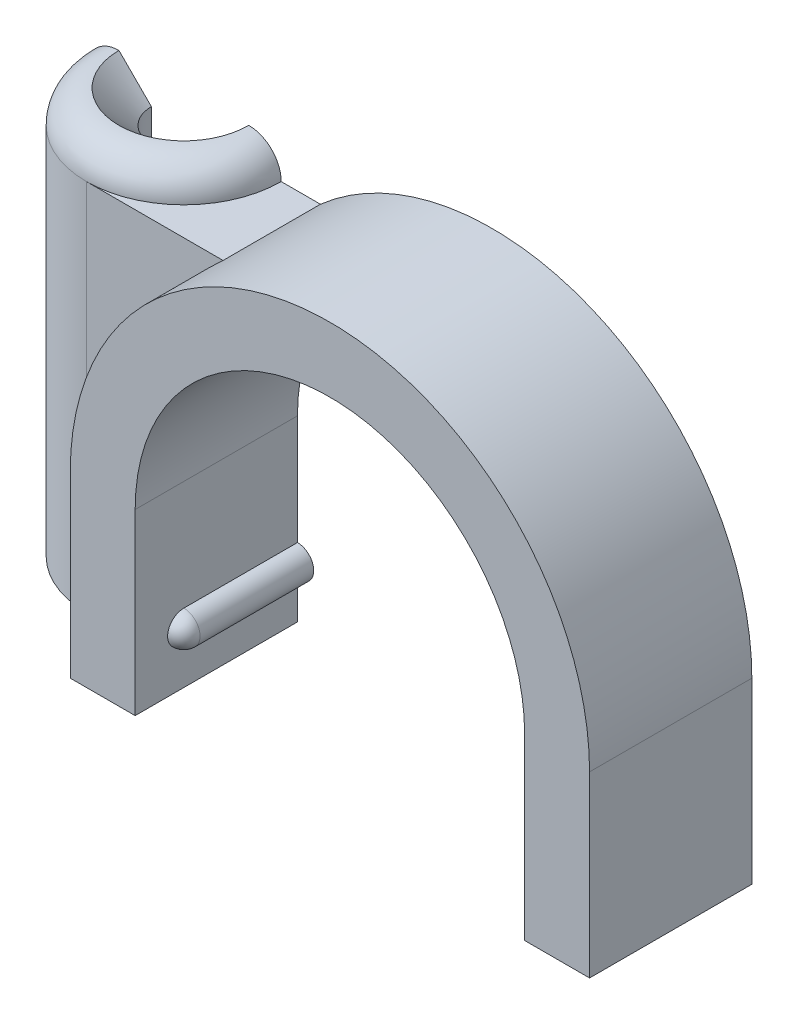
ISO-10303-21;
HEADER;
FILE_DESCRIPTION(('STEP AP214'),'2;1');
FILE_NAME('part.step','',(''),(''),'','','');
FILE_SCHEMA(('AUTOMOTIVE_DESIGN { 1 0 10303 214 1 1 1 1 }'));
ENDSEC;
DATA;
#1=APPLICATION_CONTEXT('core data for automotive mechanical design processes');
#2=APPLICATION_PROTOCOL_DEFINITION('international standard','automotive_design',2000,#1);
#3=PRODUCT_CONTEXT('',#1,'mechanical');
#4=PRODUCT('Part','Part','',(#3));
#5=PRODUCT_RELATED_PRODUCT_CATEGORY('part','',(#4));
#6=PRODUCT_DEFINITION_FORMATION('','',#4);
#7=PRODUCT_DEFINITION_CONTEXT('part definition',#1,'design');
#8=PRODUCT_DEFINITION('design','',#6,#7);
#9=PRODUCT_DEFINITION_SHAPE('','',#8);
#10=(LENGTH_UNIT() NAMED_UNIT(*) SI_UNIT(.MILLI.,.METRE.));
#11=(NAMED_UNIT(*) PLANE_ANGLE_UNIT() SI_UNIT($,.RADIAN.));
#12=(NAMED_UNIT(*) SI_UNIT($,.STERADIAN.) SOLID_ANGLE_UNIT());
#13=UNCERTAINTY_MEASURE_WITH_UNIT(LENGTH_MEASURE(1.E-05),#10,'distance_accuracy_value','');
#14=(GEOMETRIC_REPRESENTATION_CONTEXT(3) GLOBAL_UNCERTAINTY_ASSIGNED_CONTEXT((#13)) GLOBAL_UNIT_ASSIGNED_CONTEXT((#10,
#11,#12)) REPRESENTATION_CONTEXT('',''));
#15=CARTESIAN_POINT('',(0.,0.,0.));
#16=DIRECTION('',(0.,0.,1.));
#17=DIRECTION('',(1.,0.,0.));
#18=AXIS2_PLACEMENT_3D('',#15,#16,#17);
#19=CARTESIAN_POINT('',(0.,0.,-10.));
#20=DIRECTION('',(0.,-1.,0.));
#21=DIRECTION('',(0.,0.,-1.));
#22=AXIS2_PLACEMENT_3D('',#19,#20,#21);
#23=PLANE('',#22);
#24=CARTESIAN_POINT('',(-1.5,1.1369377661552E-11,-5.));
#25=DIRECTION('',(0.,1.,0.));
#26=DIRECTION('',(0.,0.,1.));
#27=AXIS2_PLACEMENT_3D('',#24,#25,#26);
#28=CIRCLE('',#27,0.999999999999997);
#29=CARTESIAN_POINT('',(-2.5,1.1369377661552E-11,-5.));
#30=VERTEX_POINT('',#29);
#31=CARTESIAN_POINT('',(-0.500000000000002,1.1369377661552E-11,-5.));
#32=VERTEX_POINT('',#31);
#33=EDGE_CURVE('E196',#30,#32,#28,.T.);
#34=ORIENTED_EDGE('',*,*,#33,.T.);
#35=DIRECTION('',(-1.,0.,0.));
#36=VECTOR('',#35,1.);
#37=CARTESIAN_POINT('',(-5.46231696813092,0.,-5.));
#38=LINE('',#37,#36);
#39=CARTESIAN_POINT('',(2.,0.,-5.));
#40=VERTEX_POINT('',#39);
#41=EDGE_CURVE('E187',#40,#32,#38,.T.);
#42=ORIENTED_EDGE('',*,*,#41,.F.);
#43=DIRECTION('',(0.,0.,1.));
#44=VECTOR('',#43,1.);
#45=CARTESIAN_POINT('',(2.,0.,-10.));
#46=LINE('',#45,#44);
#47=CARTESIAN_POINT('',(2.,0.,0.));
#48=VERTEX_POINT('',#47);
#49=EDGE_CURVE('E249',#40,#48,#46,.T.);
#50=ORIENTED_EDGE('',*,*,#49,.T.);
#51=DIRECTION('',(1.,0.,0.));
#52=VECTOR('',#51,1.);
#53=CARTESIAN_POINT('',(0.,0.,0.));
#54=LINE('',#53,#52);
#55=CARTESIAN_POINT('',(0.,0.,0.));
#56=VERTEX_POINT('',#55);
#57=EDGE_CURVE('E225',#56,#48,#54,.T.);
#58=ORIENTED_EDGE('',*,*,#57,.F.);
#59=DIRECTION('',(0.,0.,1.));
#60=VECTOR('',#59,1.);
#61=CARTESIAN_POINT('',(0.,0.,-10.));
#62=LINE('',#61,#60);
#63=CARTESIAN_POINT('',(0.,0.,-2.));
#64=VERTEX_POINT('',#63);
#65=EDGE_CURVE('E250',#64,#56,#62,.T.);
#66=ORIENTED_EDGE('',*,*,#65,.F.);
#67=DIRECTION('',(-1.,0.,0.));
#68=VECTOR('',#67,1.);
#69=CARTESIAN_POINT('',(16.001,0.,-2.));
#70=LINE('',#69,#68);
#71=CARTESIAN_POINT('',(-1.5,0.,-2.));
#72=VERTEX_POINT('',#71);
#73=EDGE_CURVE('E209',#64,#72,#70,.T.);
#74=ORIENTED_EDGE('',*,*,#73,.T.);
#75=CARTESIAN_POINT('',(-1.5,0.,-5.));
#76=DIRECTION('',(0.,-1.,0.));
#77=DIRECTION('',(0.,0.,-1.));
#78=AXIS2_PLACEMENT_3D('',#75,#76,#77);
#79=CIRCLE('',#78,3.);
#80=CARTESIAN_POINT('',(-4.5,0.,-5.));
#81=VERTEX_POINT('',#80);
#82=EDGE_CURVE('E218',#72,#81,#79,.T.);
#83=ORIENTED_EDGE('',*,*,#82,.T.);
#84=EDGE_CURVE('E181',#30,#81,#38,.T.);
#85=ORIENTED_EDGE('',*,*,#84,.F.);
#86=EDGE_LOOP('',(#34,#42,#50,#58,#66,#74,#83,#85));
#87=FACE_BOUND('',#86,.T.);
#88=ADVANCED_FACE('F29',(#87),#23,.T.);
#89=CARTESIAN_POINT('',(8.,5.5,-10.));
#90=DIRECTION('',(0.,0.,1.));
#91=DIRECTION('',(1.,0.,0.));
#92=AXIS2_PLACEMENT_3D('',#89,#90,#91);
#93=CYLINDRICAL_SURFACE('',#92,8.);
#94=DIRECTION('',(0.,0.,1.));
#95=VECTOR('',#94,1.);
#96=CARTESIAN_POINT('',(16.,5.5,-10.));
#97=LINE('',#96,#95);
#98=CARTESIAN_POINT('',(16.,5.5,-5.));
#99=VERTEX_POINT('',#98);
#100=CARTESIAN_POINT('',(16.,5.5,0.));
#101=VERTEX_POINT('',#100);
#102=EDGE_CURVE('E255',#99,#101,#97,.T.);
#103=ORIENTED_EDGE('',*,*,#102,.F.);
#104=CARTESIAN_POINT('',(8.,5.5,-5.));
#105=DIRECTION('',(0.,0.,-1.));
#106=DIRECTION('',(-1.,0.,0.));
#107=AXIS2_PLACEMENT_3D('',#104,#105,#106);
#108=CIRCLE('',#107,8.);
#109=CARTESIAN_POINT('',(2.70849737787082,11.5,-5.));
#110=VERTEX_POINT('',#109);
#111=EDGE_CURVE('E339',#110,#99,#108,.T.);
#112=ORIENTED_EDGE('',*,*,#111,.F.);
#113=DIRECTION('',(0.,0.,1.));
#114=VECTOR('',#113,1.);
#115=CARTESIAN_POINT('',(2.70849737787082,11.5,-10.));
#116=LINE('',#115,#114);
#117=CARTESIAN_POINT('',(2.70849737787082,11.5,-2.));
#118=VERTEX_POINT('',#117);
#119=EDGE_CURVE('E211',#118,#110,#116,.F.);
#120=ORIENTED_EDGE('',*,*,#119,.F.);
#121=CARTESIAN_POINT('',(8.,5.5,-2.));
#122=DIRECTION('',(0.,0.,-1.));
#123=DIRECTION('',(0.,1.,0.));
#124=AXIS2_PLACEMENT_3D('',#121,#122,#123);
#125=CIRCLE('',#124,8.);
#126=CARTESIAN_POINT('',(0.,5.5,-2.));
#127=VERTEX_POINT('',#126);
#128=EDGE_CURVE('E216',#127,#118,#125,.T.);
#129=ORIENTED_EDGE('',*,*,#128,.F.);
#130=DIRECTION('',(0.,0.,1.));
#131=VECTOR('',#130,1.);
#132=CARTESIAN_POINT('',(0.,5.5,-10.));
#133=LINE('',#132,#131);
#134=CARTESIAN_POINT('',(0.,5.5,0.));
#135=VERTEX_POINT('',#134);
#136=EDGE_CURVE('E253',#127,#135,#133,.T.);
#137=ORIENTED_EDGE('',*,*,#136,.T.);
#138=CARTESIAN_POINT('',(8.,5.5,0.));
#139=DIRECTION('',(0.,0.,1.));
#140=DIRECTION('',(-1.,0.,0.));
#141=AXIS2_PLACEMENT_3D('',#138,#139,#140);
#142=CIRCLE('',#141,8.);
#143=EDGE_CURVE('E243',#101,#135,#142,.T.);
#144=ORIENTED_EDGE('',*,*,#143,.F.);
#145=EDGE_LOOP('',(#103,#112,#120,#129,#137,#144));
#146=FACE_BOUND('',#145,.T.);
#147=ADVANCED_FACE('F291',(#146),#93,.T.);
#148=CARTESIAN_POINT('',(16.,0.,-10.));
#149=DIRECTION('',(1.,0.,0.));
#150=DIRECTION('',(0.,0.,-1.));
#151=AXIS2_PLACEMENT_3D('',#148,#149,#150);
#152=PLANE('',#151);
#153=DIRECTION('',(0.,0.,1.));
#154=VECTOR('',#153,1.);
#155=CARTESIAN_POINT('',(16.,0.,-10.));
#156=LINE('',#155,#154);
#157=CARTESIAN_POINT('',(16.,0.,-5.));
#158=VERTEX_POINT('',#157);
#159=CARTESIAN_POINT('',(16.,0.,0.));
#160=VERTEX_POINT('',#159);
#161=EDGE_CURVE('E257',#158,#160,#156,.T.);
#162=ORIENTED_EDGE('',*,*,#161,.F.);
#163=DIRECTION('',(0.,-1.,0.));
#164=VECTOR('',#163,1.);
#165=CARTESIAN_POINT('',(16.,13.9011627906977,-5.));
#166=LINE('',#165,#164);
#167=EDGE_CURVE('E343',#99,#158,#166,.T.);
#168=ORIENTED_EDGE('',*,*,#167,.F.);
#169=ORIENTED_EDGE('',*,*,#102,.T.);
#170=DIRECTION('',(0.,1.,0.));
#171=VECTOR('',#170,1.);
#172=CARTESIAN_POINT('',(16.,0.,0.));
#173=LINE('',#172,#171);
#174=EDGE_CURVE('E240',#160,#101,#173,.T.);
#175=ORIENTED_EDGE('',*,*,#174,.F.);
#176=EDGE_LOOP('',(#162,#168,#169,#175));
#177=FACE_BOUND('',#176,.T.);
#178=ADVANCED_FACE('F296',(#177),#152,.T.);
#179=CARTESIAN_POINT('',(14.,0.,-10.));
#180=DIRECTION('',(0.,-1.,0.));
#181=DIRECTION('',(0.,0.,-1.));
#182=AXIS2_PLACEMENT_3D('',#179,#180,#181);
#183=PLANE('',#182);
#184=DIRECTION('',(0.,0.,1.));
#185=VECTOR('',#184,1.);
#186=CARTESIAN_POINT('',(14.,0.,-10.));
#187=LINE('',#186,#185);
#188=CARTESIAN_POINT('',(14.,0.,-5.));
#189=VERTEX_POINT('',#188);
#190=CARTESIAN_POINT('',(14.,0.,0.));
#191=VERTEX_POINT('',#190);
#192=EDGE_CURVE('E259',#189,#191,#187,.T.);
#193=ORIENTED_EDGE('',*,*,#192,.F.);
#194=DIRECTION('',(-1.,0.,0.));
#195=VECTOR('',#194,1.);
#196=CARTESIAN_POINT('',(-5.46231696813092,0.,-5.));
#197=LINE('',#196,#195);
#198=EDGE_CURVE('E347',#158,#189,#197,.T.);
#199=ORIENTED_EDGE('',*,*,#198,.F.);
#200=ORIENTED_EDGE('',*,*,#161,.T.);
#201=DIRECTION('',(1.,0.,0.));
#202=VECTOR('',#201,1.);
#203=CARTESIAN_POINT('',(14.,0.,0.));
#204=LINE('',#203,#202);
#205=EDGE_CURVE('E237',#191,#160,#204,.T.);
#206=ORIENTED_EDGE('',*,*,#205,.F.);
#207=EDGE_LOOP('',(#193,#199,#200,#206));
#208=FACE_BOUND('',#207,.T.);
#209=ADVANCED_FACE('F389',(#208),#183,.T.);
#210=CARTESIAN_POINT('',(14.,0.,-10.));
#211=DIRECTION('',(-1.,0.,0.));
#212=DIRECTION('',(0.,0.,1.));
#213=AXIS2_PLACEMENT_3D('',#210,#211,#212);
#214=PLANE('',#213);
#215=DIRECTION('',(0.,0.,1.));
#216=VECTOR('',#215,1.);
#217=CARTESIAN_POINT('',(14.,5.5,-10.));
#218=LINE('',#217,#216);
#219=CARTESIAN_POINT('',(14.,5.5,-5.));
#220=VERTEX_POINT('',#219);
#221=CARTESIAN_POINT('',(14.,5.5,0.));
#222=VERTEX_POINT('',#221);
#223=EDGE_CURVE('E174',#220,#222,#218,.T.);
#224=ORIENTED_EDGE('',*,*,#223,.F.);
#225=DIRECTION('',(0.,1.,0.));
#226=VECTOR('',#225,1.);
#227=CARTESIAN_POINT('',(14.,13.9011627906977,-5.));
#228=LINE('',#227,#226);
#229=CARTESIAN_POINT('',(14.,2.11906828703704,-5.));
#230=VERTEX_POINT('',#229);
#231=EDGE_CURVE('E161',#230,#220,#228,.T.);
#232=ORIENTED_EDGE('',*,*,#231,.F.);
#233=DIRECTION('',(0.,0.,-1.));
#234=VECTOR('',#233,1.);
#235=CARTESIAN_POINT('',(14.,2.11906828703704,-1.));
#236=LINE('',#235,#234);
#237=CARTESIAN_POINT('',(14.,2.11906828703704,-1.5));
#238=VERTEX_POINT('',#237);
#239=EDGE_CURVE('E172',#238,#230,#236,.T.);
#240=ORIENTED_EDGE('',*,*,#239,.F.);
#241=CARTESIAN_POINT('',(14.,1.61906828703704,-1.5));
#242=DIRECTION('',(-1.,0.,0.));
#243=DIRECTION('',(0.,0.,1.));
#244=AXIS2_PLACEMENT_3D('',#241,#242,#243);
#245=CIRCLE('',#244,0.5);
#246=CARTESIAN_POINT('',(14.,1.61906828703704,-1.));
#247=VERTEX_POINT('',#246);
#248=EDGE_CURVE('E36',#238,#247,#245,.F.);
#249=ORIENTED_EDGE('',*,*,#248,.T.);
#250=CARTESIAN_POINT('',(14.,1.61906828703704,-1.5));
#251=DIRECTION('',(-1.,0.,0.));
#252=DIRECTION('',(0.,0.,1.));
#253=AXIS2_PLACEMENT_3D('',#250,#251,#252);
#254=CIRCLE('',#253,0.5);
#255=CARTESIAN_POINT('',(14.,1.11906828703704,-1.5));
#256=VERTEX_POINT('',#255);
#257=EDGE_CURVE('E11',#247,#256,#254,.F.);
#258=ORIENTED_EDGE('',*,*,#257,.T.);
#259=DIRECTION('',(0.,0.,-1.));
#260=VECTOR('',#259,1.);
#261=CARTESIAN_POINT('',(14.,1.11906828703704,-1.));
#262=LINE('',#261,#260);
#263=CARTESIAN_POINT('',(14.,1.11906828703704,-5.));
#264=VERTEX_POINT('',#263);
#265=EDGE_CURVE('E180',#256,#264,#262,.T.);
#266=ORIENTED_EDGE('',*,*,#265,.T.);
#267=EDGE_CURVE('E51',#189,#264,#228,.T.);
#268=ORIENTED_EDGE('',*,*,#267,.F.);
#269=ORIENTED_EDGE('',*,*,#192,.T.);
#270=DIRECTION('',(0.,-1.,0.));
#271=VECTOR('',#270,1.);
#272=CARTESIAN_POINT('',(14.,0.,0.));
#273=LINE('',#272,#271);
#274=EDGE_CURVE('E234',#222,#191,#273,.T.);
#275=ORIENTED_EDGE('',*,*,#274,.F.);
#276=EDGE_LOOP('',(#224,#232,#240,#249,#258,#266,#268,#269,#275));
#277=FACE_BOUND('',#276,.T.);
#278=ADVANCED_FACE('F171',(#277),#214,.T.);
#279=CARTESIAN_POINT('',(8.,5.5,-10.));
#280=DIRECTION('',(0.,0.,1.));
#281=DIRECTION('',(1.,0.,0.));
#282=AXIS2_PLACEMENT_3D('',#279,#280,#281);
#283=CYLINDRICAL_SURFACE('',#282,6.);
#284=DIRECTION('',(0.,0.,1.));
#285=VECTOR('',#284,1.);
#286=CARTESIAN_POINT('',(2.,5.5,-10.));
#287=LINE('',#286,#285);
#288=CARTESIAN_POINT('',(2.,5.5,-5.));
#289=VERTEX_POINT('',#288);
#290=CARTESIAN_POINT('',(2.,5.5,0.));
#291=VERTEX_POINT('',#290);
#292=EDGE_CURVE('E262',#289,#291,#287,.T.);
#293=ORIENTED_EDGE('',*,*,#292,.F.);
#294=CARTESIAN_POINT('',(8.,5.5,-5.));
#295=DIRECTION('',(0.,0.,-1.));
#296=DIRECTION('',(-1.,0.,0.));
#297=AXIS2_PLACEMENT_3D('',#294,#295,#296);
#298=CIRCLE('',#297,6.);
#299=EDGE_CURVE('E345',#220,#289,#298,.F.);
#300=ORIENTED_EDGE('',*,*,#299,.F.);
#301=ORIENTED_EDGE('',*,*,#223,.T.);
#302=CARTESIAN_POINT('',(8.,5.5,0.));
#303=DIRECTION('',(0.,0.,-1.));
#304=DIRECTION('',(-1.,0.,0.));
#305=AXIS2_PLACEMENT_3D('',#302,#303,#304);
#306=CIRCLE('',#305,6.);
#307=EDGE_CURVE('E231',#291,#222,#306,.T.);
#308=ORIENTED_EDGE('',*,*,#307,.F.);
#309=EDGE_LOOP('',(#293,#300,#301,#308));
#310=FACE_BOUND('',#309,.T.);
#311=ADVANCED_FACE('F374',(#310),#283,.F.);
#312=CARTESIAN_POINT('',(2.,0.,-10.));
#313=DIRECTION('',(1.,0.,0.));
#314=DIRECTION('',(0.,0.,-1.));
#315=AXIS2_PLACEMENT_3D('',#312,#313,#314);
#316=PLANE('',#315);
#317=ORIENTED_EDGE('',*,*,#49,.F.);
#318=DIRECTION('',(0.,-1.,0.));
#319=VECTOR('',#318,1.);
#320=CARTESIAN_POINT('',(2.,13.9011627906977,-5.));
#321=LINE('',#320,#319);
#322=CARTESIAN_POINT('',(2.,1.11906828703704,-5.));
#323=VERTEX_POINT('',#322);
#324=EDGE_CURVE('E312',#323,#40,#321,.T.);
#325=ORIENTED_EDGE('',*,*,#324,.F.);
#326=DIRECTION('',(0.,0.,-1.));
#327=VECTOR('',#326,1.);
#328=CARTESIAN_POINT('',(2.,1.11906828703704,-1.));
#329=LINE('',#328,#327);
#330=CARTESIAN_POINT('',(2.,1.11906828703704,-1.5));
#331=VERTEX_POINT('',#330);
#332=EDGE_CURVE('E183',#331,#323,#329,.T.);
#333=ORIENTED_EDGE('',*,*,#332,.F.);
#334=CARTESIAN_POINT('',(2.,1.61906828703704,-1.5));
#335=DIRECTION('',(1.,0.,0.));
#336=DIRECTION('',(0.,0.,-1.));
#337=AXIS2_PLACEMENT_3D('',#334,#335,#336);
#338=CIRCLE('',#337,0.5);
#339=CARTESIAN_POINT('',(2.,1.61906828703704,-1.));
#340=VERTEX_POINT('',#339);
#341=EDGE_CURVE('E272',#331,#340,#338,.F.);
#342=ORIENTED_EDGE('',*,*,#341,.T.);
#343=CARTESIAN_POINT('',(2.,1.61906828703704,-1.5));
#344=DIRECTION('',(1.,0.,0.));
#345=DIRECTION('',(0.,0.,-1.));
#346=AXIS2_PLACEMENT_3D('',#343,#344,#345);
#347=CIRCLE('',#346,0.5);
#348=CARTESIAN_POINT('',(2.,2.11906828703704,-1.5));
#349=VERTEX_POINT('',#348);
#350=EDGE_CURVE('E270',#340,#349,#347,.F.);
#351=ORIENTED_EDGE('',*,*,#350,.T.);
#352=DIRECTION('',(0.,0.,-1.));
#353=VECTOR('',#352,1.);
#354=CARTESIAN_POINT('',(2.,2.11906828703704,-1.));
#355=LINE('',#354,#353);
#356=CARTESIAN_POINT('',(2.,2.11906828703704,-5.));
#357=VERTEX_POINT('',#356);
#358=EDGE_CURVE('E193',#349,#357,#355,.T.);
#359=ORIENTED_EDGE('',*,*,#358,.T.);
#360=EDGE_CURVE('E354',#289,#357,#321,.T.);
#361=ORIENTED_EDGE('',*,*,#360,.F.);
#362=ORIENTED_EDGE('',*,*,#292,.T.);
#363=DIRECTION('',(0.,1.,0.));
#364=VECTOR('',#363,1.);
#365=CARTESIAN_POINT('',(2.,0.,0.));
#366=LINE('',#365,#364);
#367=EDGE_CURVE('E228',#48,#291,#366,.T.);
#368=ORIENTED_EDGE('',*,*,#367,.F.);
#369=EDGE_LOOP('',(#317,#325,#333,#342,#351,#359,#361,#362,#368));
#370=FACE_BOUND('',#369,.T.);
#371=ADVANCED_FACE('F363',(#370),#316,.T.);
#372=CARTESIAN_POINT('',(-1.5,12.5,-5.));
#373=DIRECTION('',(0.,-1.,0.));
#374=DIRECTION('',(0.,0.,-1.));
#375=AXIS2_PLACEMENT_3D('',#372,#373,#374);
#376=CYLINDRICAL_SURFACE('',#375,3.);
#377=CARTESIAN_POINT('',(-1.5,11.5,-5.));
#378=DIRECTION('',(0.,-1.,0.));
#379=DIRECTION('',(0.,0.,-1.));
#380=AXIS2_PLACEMENT_3D('',#377,#378,#379);
#381=CIRCLE('',#380,3.);
#382=CARTESIAN_POINT('',(-1.5,11.5,-2.));
#383=VERTEX_POINT('',#382);
#384=CARTESIAN_POINT('',(-4.5,11.5,-5.));
#385=VERTEX_POINT('',#384);
#386=EDGE_CURVE('E252',#383,#385,#381,.T.);
#387=ORIENTED_EDGE('',*,*,#386,.T.);
#388=DIRECTION('',(0.,-1.,0.));
#389=VECTOR('',#388,1.);
#390=CARTESIAN_POINT('',(-4.5,12.5,-5.));
#391=LINE('',#390,#389);
#392=EDGE_CURVE('E185',#81,#385,#391,.F.);
#393=ORIENTED_EDGE('',*,*,#392,.F.);
#394=ORIENTED_EDGE('',*,*,#82,.F.);
#395=DIRECTION('',(0.,-1.,0.));
#396=VECTOR('',#395,1.);
#397=CARTESIAN_POINT('',(-1.5,0.,-2.));
#398=LINE('',#397,#396);
#399=EDGE_CURVE('E206',#383,#72,#398,.T.);
#400=ORIENTED_EDGE('',*,*,#399,.F.);
#401=EDGE_LOOP('',(#387,#393,#394,#400));
#402=FACE_BOUND('',#401,.T.);
#403=ADVANCED_FACE('F327',(#402),#376,.T.);
#404=CARTESIAN_POINT('',(16.001,11.5,-8.));
#405=DIRECTION('',(0.,-1.,0.));
#406=DIRECTION('',(0.,0.,-1.));
#407=AXIS2_PLACEMENT_3D('',#404,#405,#406);
#408=PLANE('',#407);
#409=DIRECTION('',(-1.,0.,0.));
#410=VECTOR('',#409,1.);
#411=CARTESIAN_POINT('',(-5.46231696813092,11.5,-5.));
#412=LINE('',#411,#410);
#413=CARTESIAN_POINT('',(1.5,11.5,-5.));
#414=VERTEX_POINT('',#413);
#415=EDGE_CURVE('E342',#110,#414,#412,.T.);
#416=ORIENTED_EDGE('',*,*,#415,.T.);
#417=CARTESIAN_POINT('',(-1.5,11.5,-5.));
#418=DIRECTION('',(0.,-1.,0.));
#419=DIRECTION('',(0.,0.,-1.));
#420=AXIS2_PLACEMENT_3D('',#417,#418,#419);
#421=CIRCLE('',#420,3.);
#422=EDGE_CURVE('E214',#414,#383,#421,.T.);
#423=ORIENTED_EDGE('',*,*,#422,.T.);
#424=DIRECTION('',(-1.,0.,0.));
#425=VECTOR('',#424,1.);
#426=CARTESIAN_POINT('',(16.001,11.5,-2.));
#427=LINE('',#426,#425);
#428=EDGE_CURVE('E210',#118,#383,#427,.T.);
#429=ORIENTED_EDGE('',*,*,#428,.F.);
#430=ORIENTED_EDGE('',*,*,#119,.T.);
#431=EDGE_LOOP('',(#416,#423,#429,#430));
#432=FACE_BOUND('',#431,.T.);
#433=ADVANCED_FACE('F335',(#432),#408,.F.);
#434=CARTESIAN_POINT('',(-1.5,11.5,-5.));
#435=DIRECTION('',(0.,-1.,0.));
#436=DIRECTION('',(0.,0.,-1.));
#437=AXIS2_PLACEMENT_3D('',#434,#435,#436);
#438=TOROIDAL_SURFACE('',#437,2.,1.);
#439=ORIENTED_EDGE('',*,*,#422,.F.);
#440=CARTESIAN_POINT('',(0.500000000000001,11.5,-5.));
#441=DIRECTION('',(0.,0.,-1.));
#442=DIRECTION('',(-1.,0.,0.));
#443=AXIS2_PLACEMENT_3D('',#440,#441,#442);
#444=CIRCLE('',#443,1.);
#445=CARTESIAN_POINT('',(0.500000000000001,12.5,-5.));
#446=VERTEX_POINT('',#445);
#447=EDGE_CURVE('E352',#446,#414,#444,.T.);
#448=ORIENTED_EDGE('',*,*,#447,.F.);
#449=CARTESIAN_POINT('',(-1.5,12.5,-5.));
#450=DIRECTION('',(0.,1.,0.));
#451=DIRECTION('',(0.,0.,1.));
#452=AXIS2_PLACEMENT_3D('',#449,#450,#451);
#453=CIRCLE('',#452,2.);
#454=CARTESIAN_POINT('',(-3.5,12.5,-5.));
#455=VERTEX_POINT('',#454);
#456=EDGE_CURVE('E202',#455,#446,#453,.T.);
#457=ORIENTED_EDGE('',*,*,#456,.F.);
#458=CARTESIAN_POINT('',(-3.5,11.5,-5.));
#459=DIRECTION('',(0.,0.,-1.));
#460=DIRECTION('',(-1.,0.,0.));
#461=AXIS2_PLACEMENT_3D('',#458,#459,#460);
#462=CIRCLE('',#461,1.);
#463=EDGE_CURVE('E315',#385,#455,#462,.T.);
#464=ORIENTED_EDGE('',*,*,#463,.F.);
#465=ORIENTED_EDGE('',*,*,#386,.F.);
#466=EDGE_LOOP('',(#439,#448,#457,#464,#465));
#467=FACE_BOUND('',#466,.T.);
#468=ADVANCED_FACE('F324',(#467),#438,.T.);
#469=CARTESIAN_POINT('',(-1.5,12.5,-5.));
#470=DIRECTION('',(0.,1.,0.));
#471=DIRECTION('',(0.,0.,1.));
#472=AXIS2_PLACEMENT_3D('',#469,#470,#471);
#473=CONICAL_SURFACE('',#472,2.,0.785398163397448);
#474=DIRECTION('',(-0.707106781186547,-0.707106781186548,0.));
#475=VECTOR('',#474,1.);
#476=CARTESIAN_POINT('',(-1.5,10.5,-5.));
#477=LINE('',#476,#475);
#478=CARTESIAN_POINT('',(-0.5,11.5,-5.));
#479=VERTEX_POINT('',#478);
#480=EDGE_CURVE('E358',#446,#479,#477,.T.);
#481=ORIENTED_EDGE('',*,*,#480,.T.);
#482=CARTESIAN_POINT('',(-1.5,11.5,-5.));
#483=DIRECTION('',(0.,1.,0.));
#484=DIRECTION('',(0.,0.,1.));
#485=AXIS2_PLACEMENT_3D('',#482,#483,#484);
#486=CIRCLE('',#485,0.999999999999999);
#487=CARTESIAN_POINT('',(-2.5,11.5,-5.));
#488=VERTEX_POINT('',#487);
#489=EDGE_CURVE('E199',#488,#479,#486,.T.);
#490=ORIENTED_EDGE('',*,*,#489,.F.);
#491=DIRECTION('',(-0.707106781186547,0.707106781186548,0.));
#492=VECTOR('',#491,1.);
#493=CARTESIAN_POINT('',(-1.5,10.5,-5.));
#494=LINE('',#493,#492);
#495=EDGE_CURVE('E43',#488,#455,#494,.T.);
#496=ORIENTED_EDGE('',*,*,#495,.T.);
#497=ORIENTED_EDGE('',*,*,#456,.T.);
#498=EDGE_LOOP('',(#481,#490,#496,#497));
#499=FACE_BOUND('',#498,.T.);
#500=ADVANCED_FACE('F424',(#499),#473,.F.);
#501=CARTESIAN_POINT('',(-1.5,12.5,-5.));
#502=DIRECTION('',(0.,1.,0.));
#503=DIRECTION('',(0.,0.,1.));
#504=AXIS2_PLACEMENT_3D('',#501,#502,#503);
#505=CYLINDRICAL_SURFACE('',#504,0.999999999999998);
#506=DIRECTION('',(0.,1.,0.));
#507=VECTOR('',#506,1.);
#508=CARTESIAN_POINT('',(-0.500000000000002,12.5,-5.));
#509=LINE('',#508,#507);
#510=EDGE_CURVE('E308',#479,#32,#509,.F.);
#511=ORIENTED_EDGE('',*,*,#510,.T.);
#512=ORIENTED_EDGE('',*,*,#33,.F.);
#513=DIRECTION('',(0.,1.,0.));
#514=VECTOR('',#513,1.);
#515=CARTESIAN_POINT('',(-2.5,12.5,-5.));
#516=LINE('',#515,#514);
#517=EDGE_CURVE('E306',#30,#488,#516,.T.);
#518=ORIENTED_EDGE('',*,*,#517,.T.);
#519=ORIENTED_EDGE('',*,*,#489,.T.);
#520=EDGE_LOOP('',(#511,#512,#518,#519));
#521=FACE_BOUND('',#520,.T.);
#522=ADVANCED_FACE('F305',(#521),#505,.F.);
#523=CARTESIAN_POINT('',(2.,1.61906828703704,-1.));
#524=DIRECTION('',(0.,0.,-1.));
#525=DIRECTION('',(-1.,0.,0.));
#526=AXIS2_PLACEMENT_3D('',#523,#524,#525);
#527=CYLINDRICAL_SURFACE('',#526,0.5);
#528=CARTESIAN_POINT('',(2.,1.61906828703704,-5.));
#529=DIRECTION('',(0.,0.,-1.));
#530=DIRECTION('',(-1.,0.,0.));
#531=AXIS2_PLACEMENT_3D('',#528,#529,#530);
#532=CIRCLE('',#531,0.5);
#533=EDGE_CURVE('E356',#323,#357,#532,.F.);
#534=ORIENTED_EDGE('',*,*,#533,.T.);
#535=ORIENTED_EDGE('',*,*,#358,.F.);
#536=CARTESIAN_POINT('',(2.,1.61906828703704,-1.5));
#537=DIRECTION('',(0.,0.,-1.));
#538=DIRECTION('',(-1.,0.,0.));
#539=AXIS2_PLACEMENT_3D('',#536,#537,#538);
#540=CIRCLE('',#539,0.5);
#541=EDGE_CURVE('E267',#349,#331,#540,.T.);
#542=ORIENTED_EDGE('',*,*,#541,.T.);
#543=ORIENTED_EDGE('',*,*,#332,.T.);
#544=EDGE_LOOP('',(#534,#535,#542,#543));
#545=FACE_BOUND('',#544,.T.);
#546=ADVANCED_FACE('F366',(#545),#527,.T.);
#547=CARTESIAN_POINT('',(14.,1.61906828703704,-1.));
#548=DIRECTION('',(0.,0.,-1.));
#549=DIRECTION('',(-1.,0.,0.));
#550=AXIS2_PLACEMENT_3D('',#547,#548,#549);
#551=CYLINDRICAL_SURFACE('',#550,0.5);
#552=ORIENTED_EDGE('',*,*,#239,.T.);
#553=CARTESIAN_POINT('',(14.,1.61906828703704,-5.));
#554=DIRECTION('',(0.,0.,-1.));
#555=DIRECTION('',(-1.,0.,0.));
#556=AXIS2_PLACEMENT_3D('',#553,#554,#555);
#557=CIRCLE('',#556,0.5);
#558=EDGE_CURVE('E158',#264,#230,#557,.T.);
#559=ORIENTED_EDGE('',*,*,#558,.F.);
#560=ORIENTED_EDGE('',*,*,#265,.F.);
#561=CARTESIAN_POINT('',(14.,1.61906828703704,-1.5));
#562=DIRECTION('',(0.,0.,-1.));
#563=DIRECTION('',(-1.,0.,0.));
#564=AXIS2_PLACEMENT_3D('',#561,#562,#563);
#565=CIRCLE('',#564,0.5);
#566=EDGE_CURVE('E179',#256,#238,#565,.T.);
#567=ORIENTED_EDGE('',*,*,#566,.T.);
#568=EDGE_LOOP('',(#552,#559,#560,#567));
#569=FACE_BOUND('',#568,.T.);
#570=ADVANCED_FACE('F177',(#569),#551,.T.);
#571=CARTESIAN_POINT('',(0.,0.,-10.));
#572=DIRECTION('',(-1.,0.,0.));
#573=DIRECTION('',(0.,0.,1.));
#574=AXIS2_PLACEMENT_3D('',#571,#572,#573);
#575=PLANE('',#574);
#576=ORIENTED_EDGE('',*,*,#136,.F.);
#577=DIRECTION('',(0.,1.,0.));
#578=VECTOR('',#577,1.);
#579=CARTESIAN_POINT('',(0.,0.,-2.));
#580=LINE('',#579,#578);
#581=EDGE_CURVE('E205',#64,#127,#580,.T.);
#582=ORIENTED_EDGE('',*,*,#581,.F.);
#583=ORIENTED_EDGE('',*,*,#65,.T.);
#584=DIRECTION('',(0.,-1.,0.));
#585=VECTOR('',#584,1.);
#586=CARTESIAN_POINT('',(0.,0.,0.));
#587=LINE('',#586,#585);
#588=EDGE_CURVE('E246',#135,#56,#587,.T.);
#589=ORIENTED_EDGE('',*,*,#588,.F.);
#590=EDGE_LOOP('',(#576,#582,#583,#589));
#591=FACE_BOUND('',#590,.T.);
#592=ADVANCED_FACE('F381',(#591),#575,.T.);
#593=CARTESIAN_POINT('',(8.,5.5,0.));
#594=DIRECTION('',(0.,0.,-1.));
#595=DIRECTION('',(-1.,0.,0.));
#596=AXIS2_PLACEMENT_3D('',#593,#594,#595);
#597=PLANE('',#596);
#598=ORIENTED_EDGE('',*,*,#57,.T.);
#599=ORIENTED_EDGE('',*,*,#367,.T.);
#600=ORIENTED_EDGE('',*,*,#307,.T.);
#601=ORIENTED_EDGE('',*,*,#274,.T.);
#602=ORIENTED_EDGE('',*,*,#205,.T.);
#603=ORIENTED_EDGE('',*,*,#174,.T.);
#604=ORIENTED_EDGE('',*,*,#143,.T.);
#605=ORIENTED_EDGE('',*,*,#588,.T.);
#606=EDGE_LOOP('',(#598,#599,#600,#601,#602,#603,#604,#605));
#607=FACE_BOUND('',#606,.T.);
#608=ADVANCED_FACE('F376',(#607),#597,.F.);
#609=CARTESIAN_POINT('',(16.001,0.,-2.));
#610=DIRECTION('',(0.,0.,-1.));
#611=DIRECTION('',(0.,1.,0.));
#612=AXIS2_PLACEMENT_3D('',#609,#610,#611);
#613=PLANE('',#612);
#614=ORIENTED_EDGE('',*,*,#73,.F.);
#615=ORIENTED_EDGE('',*,*,#581,.T.);
#616=ORIENTED_EDGE('',*,*,#128,.T.);
#617=ORIENTED_EDGE('',*,*,#428,.T.);
#618=ORIENTED_EDGE('',*,*,#399,.T.);
#619=EDGE_LOOP('',(#614,#615,#616,#617,#618));
#620=FACE_BOUND('',#619,.T.);
#621=ADVANCED_FACE('F286',(#620),#613,.F.);
#622=CARTESIAN_POINT('',(2.,1.61906828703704,-1.5));
#623=DIRECTION('',(0.,0.,1.));
#624=DIRECTION('',(1.,0.,0.));
#625=AXIS2_PLACEMENT_3D('',#622,#623,#624);
#626=SPHERICAL_SURFACE('',#625,0.5);
#627=ORIENTED_EDGE('',*,*,#341,.F.);
#628=ORIENTED_EDGE('',*,*,#541,.F.);
#629=ORIENTED_EDGE('',*,*,#350,.F.);
#630=EDGE_LOOP('',(#627,#628,#629));
#631=FACE_BOUND('',#630,.T.);
#632=ADVANCED_FACE('F278',(#631),#626,.T.);
#633=CARTESIAN_POINT('',(14.,1.61906828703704,-1.5));
#634=DIRECTION('',(0.,0.,1.));
#635=DIRECTION('',(1.,0.,0.));
#636=AXIS2_PLACEMENT_3D('',#633,#634,#635);
#637=SPHERICAL_SURFACE('',#636,0.5);
#638=ORIENTED_EDGE('',*,*,#566,.F.);
#639=ORIENTED_EDGE('',*,*,#257,.F.);
#640=ORIENTED_EDGE('',*,*,#248,.F.);
#641=EDGE_LOOP('',(#638,#639,#640));
#642=FACE_BOUND('',#641,.T.);
#643=ADVANCED_FACE('F276',(#642),#637,.T.);
#644=CARTESIAN_POINT('',(-5.46231696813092,13.9011627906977,-5.));
#645=DIRECTION('',(0.,0.,-1.));
#646=DIRECTION('',(-1.,0.,0.));
#647=AXIS2_PLACEMENT_3D('',#644,#645,#646);
#648=PLANE('',#647);
#649=ORIENTED_EDGE('',*,*,#480,.F.);
#650=ORIENTED_EDGE('',*,*,#447,.T.);
#651=ORIENTED_EDGE('',*,*,#415,.F.);
#652=ORIENTED_EDGE('',*,*,#111,.T.);
#653=ORIENTED_EDGE('',*,*,#167,.T.);
#654=ORIENTED_EDGE('',*,*,#198,.T.);
#655=ORIENTED_EDGE('',*,*,#267,.T.);
#656=ORIENTED_EDGE('',*,*,#558,.T.);
#657=ORIENTED_EDGE('',*,*,#231,.T.);
#658=ORIENTED_EDGE('',*,*,#299,.T.);
#659=ORIENTED_EDGE('',*,*,#360,.T.);
#660=ORIENTED_EDGE('',*,*,#533,.F.);
#661=ORIENTED_EDGE('',*,*,#324,.T.);
#662=ORIENTED_EDGE('',*,*,#41,.T.);
#663=ORIENTED_EDGE('',*,*,#510,.F.);
#664=EDGE_LOOP('',(#649,#650,#651,#652,#653,#654,#655,#656,#657,#658,#659,#660,#661,#662,#663));
#665=FACE_BOUND('',#664,.T.);
#666=ADVANCED_FACE('F160',(#665),#648,.T.);
#667=ORIENTED_EDGE('',*,*,#84,.T.);
#668=ORIENTED_EDGE('',*,*,#392,.T.);
#669=ORIENTED_EDGE('',*,*,#463,.T.);
#670=ORIENTED_EDGE('',*,*,#495,.F.);
#671=ORIENTED_EDGE('',*,*,#517,.F.);
#672=EDGE_LOOP('',(#667,#668,#669,#670,#671));
#673=FACE_BOUND('',#672,.T.);
#674=ADVANCED_FACE('F284',(#673),#648,.T.);
#675=CLOSED_SHELL('',(#88,#147,#178,#209,#278,#311,#371,#403,#433,#468,#500,#522,#546,#570,#592,
#608,#621,#632,#643,#666,#674));
#676=MANIFOLD_SOLID_BREP('B2',#675);
#677=ADVANCED_BREP_SHAPE_REPRESENTATION('',(#18,#676),#14);
#678=SHAPE_DEFINITION_REPRESENTATION(#9,#677);
ENDSEC;
END-ISO-10303-21;
